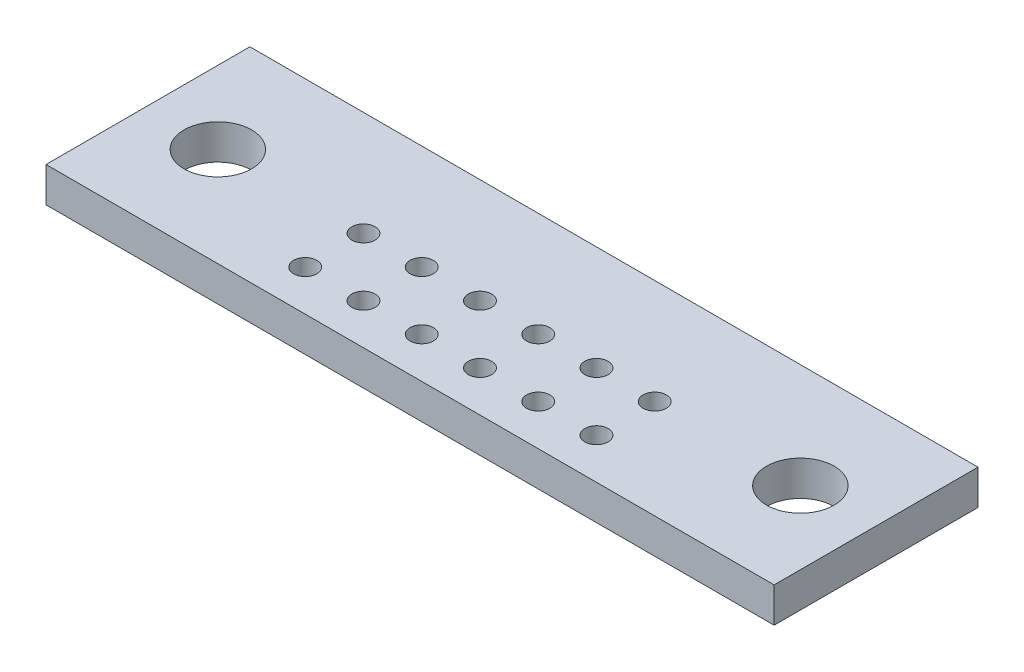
from build123d import *

# Parameters (mm, degrees)
SKETCH1_W      = 31.75
SKETCH1_H      = 8.89
SKETCH1_R      = 0.508
SKETCH1_R_2    = 1.4732
EXTRUDE1_DEPTH = 1.524


with BuildPart() as part:
    # Sketch1 → Extrude1 (new body)
    with BuildSketch(Plane(origin=(0, 0, 0), x_dir=(1, 0, 0), z_dir=(0, 1, 0))):
        with Locations((15.875, 4.445)):
            Rectangle(SKETCH1_W, SKETCH1_H)
        with Locations(Location((17.145, 4.318, 0), (0, 0, 270))):
            Circle(SKETCH1_R, mode=Mode.SUBTRACT)
        with Locations(Location((19.685, 4.318, 0), (0, 0, 270))):
            Circle(SKETCH1_R, mode=Mode.SUBTRACT)
        with Locations(Location((22.225, 4.318, 0), (0, 0, 270))):
            Circle(SKETCH1_R, mode=Mode.SUBTRACT)
        with Locations(Location((9.525, 4.318, 0), (0, 0, 90))):
            Circle(SKETCH1_R, mode=Mode.SUBTRACT)
        with Locations(Location((12.065, 4.318, 0), (0, 0, 90))):
            Circle(SKETCH1_R, mode=Mode.SUBTRACT)
        with Locations(Location((14.605, 4.318, 0), (0, 0, 90))):
            Circle(SKETCH1_R, mode=Mode.SUBTRACT)
        with Locations(Location((14.605, 1.778, 0), (0, 0, 270))):
            Circle(SKETCH1_R, mode=Mode.SUBTRACT)
        with Locations(Location((12.065, 1.778, 0), (0, 0, 270))):
            Circle(SKETCH1_R, mode=Mode.SUBTRACT)
        with Locations(Location((9.525, 1.778, 0), (0, 0, 270))):
            Circle(SKETCH1_R, mode=Mode.SUBTRACT)
        with Locations(Location((22.225, 1.778, 0), (0, 0, 90))):
            Circle(SKETCH1_R, mode=Mode.SUBTRACT)
        with Locations(Location((19.685, 1.778, 0), (0, 0, 90))):
            Circle(SKETCH1_R, mode=Mode.SUBTRACT)
        with Locations(Location((17.145, 1.778, 0), (0, 0, 90))):
            Circle(SKETCH1_R, mode=Mode.SUBTRACT)
        with Locations(Location((28.575, 4.318, 0), (0, 0, 90))):
            Circle(SKETCH1_R_2, mode=Mode.SUBTRACT)
        with Locations(Location((3.175, 4.318, 0), (0, 0, 90))):
            Circle(SKETCH1_R_2, mode=Mode.SUBTRACT)
    extrude(amount=EXTRUDE1_DEPTH)


solid = part.part
